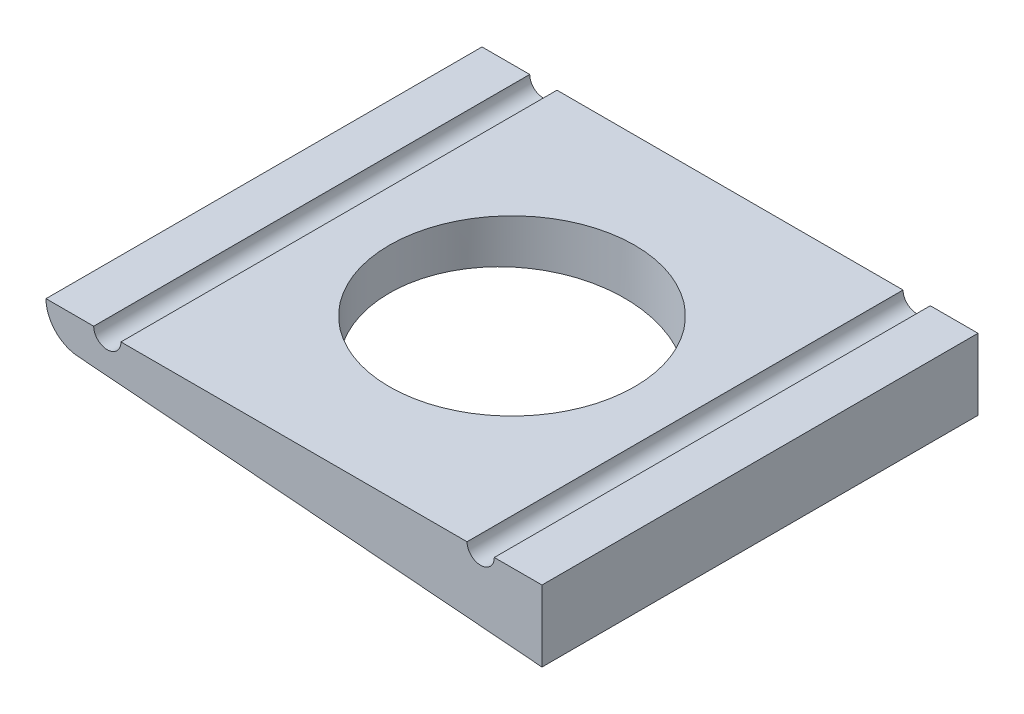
from build123d import *

# Parameters (mm, degrees)
EXTRUSION1_DEPTH        = 16
ESQUISSE2_R             = 9
ENL_V_MAT_EXTRU_1_DEPTH = 25.788379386


with BuildPart() as part:
    # Esquisse1 → Extrusion1 (new, symmetric)
    with BuildSketch(Plane.XY):
        with BuildLine():
            Line((-12.7, 0), (12.7, 0))
            ThreePointArc((12.7, 0), (13.7, -1), (14.7, 0))
            Line((14.7, 0), (18.2, 0))
            Line((18.2, 0), (18.2, -5.217638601))
            Line((18.2, -5.217638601), (-15.899192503, -2.492051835))
            ThreePointArc((-15.899192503, -2.492051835), (-17.53684257, -1.695880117), (-18.2, 0))
            Line((-18.2, 0), (-14.7, 0))
            ThreePointArc((-14.7, 0), (-13.7, -1), (-12.7, 0))
        make_face()
    extrude(amount=EXTRUSION1_DEPTH, both=True)

    # Esquisse2 → Enl_v. mat.-Extru.1 (cut, through all)
    with BuildSketch(Plane(origin=(0, 0, 0), x_dir=(-1, 0, 0), z_dir=(0, 1, 0))):
        Circle(ESQUISSE2_R)
    extrude(amount=-ENL_V_MAT_EXTRU_1_DEPTH, mode=Mode.SUBTRACT)


solid = part.part
